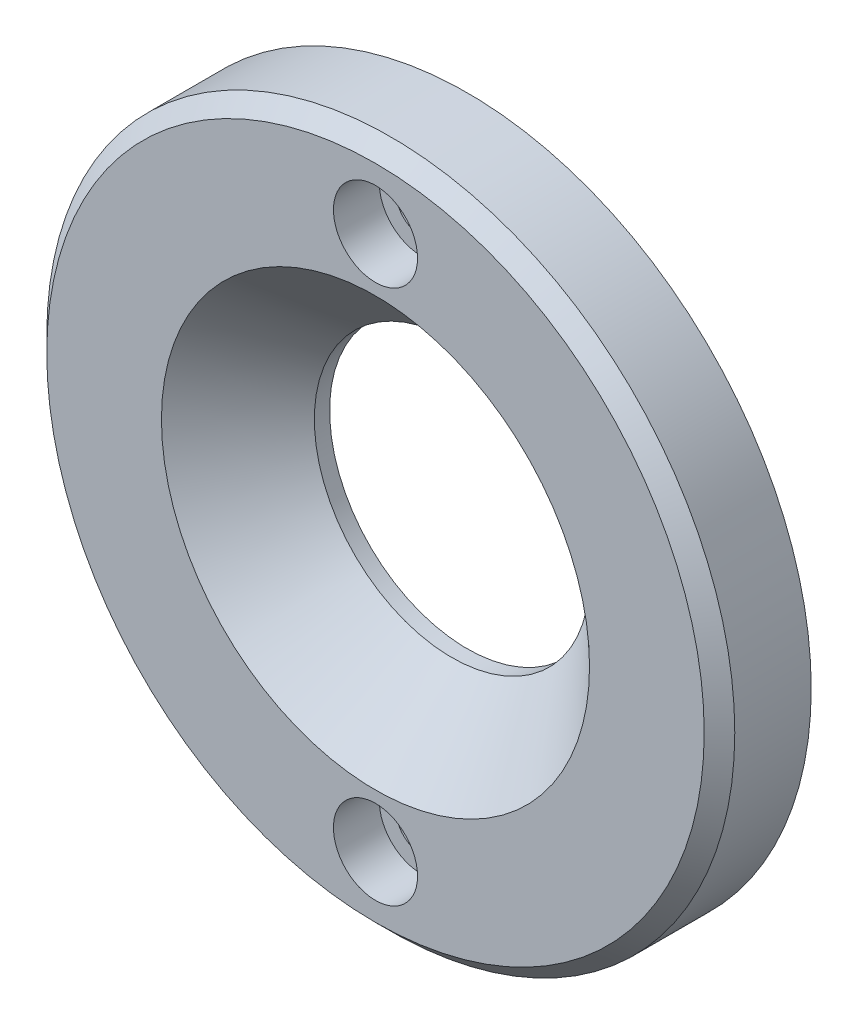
ISO-10303-21;
HEADER;
FILE_DESCRIPTION(('STEP AP214'),'2;1');
FILE_NAME('part.step','',(''),(''),'','','');
FILE_SCHEMA(('AUTOMOTIVE_DESIGN { 1 0 10303 214 1 1 1 1 }'));
ENDSEC;
DATA;
#1=APPLICATION_CONTEXT('core data for automotive mechanical design processes');
#2=APPLICATION_PROTOCOL_DEFINITION('international standard','automotive_design',2000,#1);
#3=PRODUCT_CONTEXT('',#1,'mechanical');
#4=PRODUCT('Part','Part','',(#3));
#5=PRODUCT_RELATED_PRODUCT_CATEGORY('part','',(#4));
#6=PRODUCT_DEFINITION_FORMATION('','',#4);
#7=PRODUCT_DEFINITION_CONTEXT('part definition',#1,'design');
#8=PRODUCT_DEFINITION('design','',#6,#7);
#9=PRODUCT_DEFINITION_SHAPE('','',#8);
#10=(LENGTH_UNIT() NAMED_UNIT(*) SI_UNIT(.MILLI.,.METRE.));
#11=(NAMED_UNIT(*) PLANE_ANGLE_UNIT() SI_UNIT($,.RADIAN.));
#12=(NAMED_UNIT(*) SI_UNIT($,.STERADIAN.) SOLID_ANGLE_UNIT());
#13=UNCERTAINTY_MEASURE_WITH_UNIT(LENGTH_MEASURE(1.E-05),#10,'distance_accuracy_value','');
#14=(GEOMETRIC_REPRESENTATION_CONTEXT(3) GLOBAL_UNCERTAINTY_ASSIGNED_CONTEXT((#13)) GLOBAL_UNIT_ASSIGNED_CONTEXT((#10,
#11,#12)) REPRESENTATION_CONTEXT('',''));
#15=CARTESIAN_POINT('',(0.,0.,0.));
#16=DIRECTION('',(0.,0.,1.));
#17=DIRECTION('',(1.,0.,0.));
#18=AXIS2_PLACEMENT_3D('',#15,#16,#17);
#19=CARTESIAN_POINT('',(2.17881268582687E-12,0.,12.));
#20=DIRECTION('',(0.,0.,-1.));
#21=DIRECTION('',(-0.999999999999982,0.,0.));
#22=AXIS2_PLACEMENT_3D('',#19,#20,#21);
#23=CYLINDRICAL_SURFACE('',#22,45.);
#24=CARTESIAN_POINT('',(2.17881268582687E-12,-2.19269047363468E-12,9.99999999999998));
#25=DIRECTION('',(0.,0.,1.));
#26=DIRECTION('',(0.999999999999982,0.,0.));
#27=AXIS2_PLACEMENT_3D('',#24,#25,#26);
#28=CIRCLE('',#27,45.);
#29=CARTESIAN_POINT('',(45.0000000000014,-1.39832589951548E-12,9.99999999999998));
#30=VERTEX_POINT('',#29);
#31=EDGE_CURVE('E53',#30,#30,#28,.F.);
#32=ORIENTED_EDGE('',*,*,#31,.T.);
#33=EDGE_LOOP('',(#32));
#34=FACE_BOUND('',#33,.T.);
#35=CARTESIAN_POINT('',(0.,0.,0.));
#36=DIRECTION('',(0.,0.,1.));
#37=DIRECTION('',(0.999999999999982,0.,0.));
#38=AXIS2_PLACEMENT_3D('',#35,#36,#37);
#39=CIRCLE('',#38,45.);
#40=CARTESIAN_POINT('',(44.9999999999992,7.94364574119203E-13,0.));
#41=VERTEX_POINT('',#40);
#42=EDGE_CURVE('E62',#41,#41,#39,.T.);
#43=ORIENTED_EDGE('',*,*,#42,.T.);
#44=EDGE_LOOP('',(#43));
#45=FACE_BOUND('',#44,.T.);
#46=ADVANCED_FACE('F43',(#34,#45),#23,.T.);
#47=CARTESIAN_POINT('',(2.17881268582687E-12,0.,12.));
#48=DIRECTION('',(0.,0.,1.));
#49=DIRECTION('',(0.999999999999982,0.,0.));
#50=AXIS2_PLACEMENT_3D('',#47,#48,#49);
#51=PLANE('',#50);
#52=CARTESIAN_POINT('',(2.23432383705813E-12,35.,12.));
#53=DIRECTION('',(0.,0.,1.));
#54=DIRECTION('',(0.999999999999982,0.,0.));
#55=AXIS2_PLACEMENT_3D('',#52,#53,#54);
#56=CIRCLE('',#55,5.49999999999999);
#57=CARTESIAN_POINT('',(5.50000000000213,35.0000000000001,12.));
#58=VERTEX_POINT('',#57);
#59=EDGE_CURVE('E80',#58,#58,#56,.T.);
#60=ORIENTED_EDGE('',*,*,#59,.F.);
#61=EDGE_LOOP('',(#60));
#62=FACE_BOUND('',#61,.T.);
#63=CARTESIAN_POINT('',(2.15105711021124E-12,-35.,12.));
#64=DIRECTION('',(0.,0.,1.));
#65=DIRECTION('',(0.999999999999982,0.,0.));
#66=AXIS2_PLACEMENT_3D('',#63,#64,#65);
#67=CIRCLE('',#66,5.49999999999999);
#68=CARTESIAN_POINT('',(5.50000000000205,-34.9999999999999,12.));
#69=VERTEX_POINT('',#68);
#70=EDGE_CURVE('E68',#69,#69,#67,.T.);
#71=ORIENTED_EDGE('',*,*,#70,.F.);
#72=EDGE_LOOP('',(#71));
#73=FACE_BOUND('',#72,.T.);
#74=CARTESIAN_POINT('',(2.17881268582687E-12,0.,12.));
#75=DIRECTION('',(0.,0.,1.));
#76=DIRECTION('',(0.999999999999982,0.,0.));
#77=AXIS2_PLACEMENT_3D('',#74,#75,#76);
#78=CIRCLE('',#77,28.);
#79=CARTESIAN_POINT('',(28.0000000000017,4.9427129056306E-13,12.));
#80=VERTEX_POINT('',#79);
#81=EDGE_CURVE('E12',#80,#80,#78,.F.);
#82=ORIENTED_EDGE('',*,*,#81,.T.);
#83=EDGE_LOOP('',(#82));
#84=FACE_BOUND('',#83,.T.);
#85=CARTESIAN_POINT('',(2.17881268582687E-12,0.,12.));
#86=DIRECTION('',(0.,0.,1.));
#87=DIRECTION('',(0.999999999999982,0.,0.));
#88=AXIS2_PLACEMENT_3D('',#85,#86,#87);
#89=CIRCLE('',#88,43.);
#90=CARTESIAN_POINT('',(43.0000000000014,7.59059481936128E-13,12.));
#91=VERTEX_POINT('',#90);
#92=EDGE_CURVE('E57',#91,#91,#89,.T.);
#93=ORIENTED_EDGE('',*,*,#92,.T.);
#94=EDGE_LOOP('',(#93));
#95=FACE_BOUND('',#94,.T.);
#96=ADVANCED_FACE('F115',(#62,#73,#84,#95),#51,.T.);
#97=CARTESIAN_POINT('',(0.,0.,0.));
#98=DIRECTION('',(0.,0.,1.));
#99=DIRECTION('',(0.999999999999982,0.,0.));
#100=AXIS2_PLACEMENT_3D('',#97,#98,#99);
#101=PLANE('',#100);
#102=CARTESIAN_POINT('',(0.,35.,1.10328413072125E-12));
#103=DIRECTION('',(0.,0.,1.));
#104=DIRECTION('',(0.999999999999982,0.,0.));
#105=AXIS2_PLACEMENT_3D('',#102,#103,#104);
#106=CIRCLE('',#105,3.3);
#107=CARTESIAN_POINT('',(3.30000000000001,35.0000000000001,1.10328413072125E-12));
#108=VERTEX_POINT('',#107);
#109=EDGE_CURVE('E89',#108,#108,#106,.T.);
#110=ORIENTED_EDGE('',*,*,#109,.T.);
#111=EDGE_LOOP('',(#110));
#112=FACE_BOUND('',#111,.T.);
#113=CARTESIAN_POINT('',(0.,-35.,0.));
#114=DIRECTION('',(0.,0.,1.));
#115=DIRECTION('',(0.999999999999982,0.,0.));
#116=AXIS2_PLACEMENT_3D('',#113,#114,#115);
#117=CIRCLE('',#116,3.3);
#118=CARTESIAN_POINT('',(3.29999999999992,-35.,0.));
#119=VERTEX_POINT('',#118);
#120=EDGE_CURVE('E77',#119,#119,#117,.T.);
#121=ORIENTED_EDGE('',*,*,#120,.T.);
#122=EDGE_LOOP('',(#121));
#123=FACE_BOUND('',#122,.T.);
#124=CARTESIAN_POINT('',(0.,0.,0.));
#125=DIRECTION('',(0.,0.,1.));
#126=DIRECTION('',(0.999999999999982,0.,0.));
#127=AXIS2_PLACEMENT_3D('',#124,#125,#126);
#128=CIRCLE('',#127,18.);
#129=CARTESIAN_POINT('',(17.9999999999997,3.17745829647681E-13,0.));
#130=VERTEX_POINT('',#129);
#131=EDGE_CURVE('E65',#130,#130,#128,.T.);
#132=ORIENTED_EDGE('',*,*,#131,.T.);
#133=EDGE_LOOP('',(#132));
#134=FACE_BOUND('',#133,.T.);
#135=ORIENTED_EDGE('',*,*,#42,.F.);
#136=EDGE_LOOP('',(#135));
#137=FACE_BOUND('',#136,.T.);
#138=ADVANCED_FACE('F93',(#112,#123,#134,#137),#101,.F.);
#139=CARTESIAN_POINT('',(2.17881268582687E-12,0.,12.));
#140=DIRECTION('',(0.,0.,-1.));
#141=DIRECTION('',(-0.999999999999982,0.,0.));
#142=AXIS2_PLACEMENT_3D('',#139,#140,#141);
#143=CONICAL_SURFACE('',#142,43.,0.785398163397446);
#144=ORIENTED_EDGE('',*,*,#31,.F.);
#145=EDGE_LOOP('',(#144));
#146=FACE_BOUND('',#145,.T.);
#147=ORIENTED_EDGE('',*,*,#92,.F.);
#148=EDGE_LOOP('',(#147));
#149=FACE_BOUND('',#148,.T.);
#150=ADVANCED_FACE('F122',(#146,#149),#143,.T.);
#151=CARTESIAN_POINT('',(0.,0.,0.));
#152=DIRECTION('',(0.,0.,1.));
#153=DIRECTION('',(0.999999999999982,0.,0.));
#154=AXIS2_PLACEMENT_3D('',#151,#152,#153);
#155=CYLINDRICAL_SURFACE('',#154,18.);
#156=CARTESIAN_POINT('',(2.17881268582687E-12,0.,2.));
#157=DIRECTION('',(0.,0.,1.));
#158=DIRECTION('',(0.999999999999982,0.,0.));
#159=AXIS2_PLACEMENT_3D('',#156,#157,#158);
#160=CIRCLE('',#159,18.);
#161=CARTESIAN_POINT('',(18.0000000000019,3.17745829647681E-13,2.));
#162=VERTEX_POINT('',#161);
#163=EDGE_CURVE('E49',#162,#162,#160,.T.);
#164=ORIENTED_EDGE('',*,*,#163,.T.);
#165=EDGE_LOOP('',(#164));
#166=FACE_BOUND('',#165,.T.);
#167=ORIENTED_EDGE('',*,*,#131,.F.);
#168=EDGE_LOOP('',(#167));
#169=FACE_BOUND('',#168,.T.);
#170=ADVANCED_FACE('F124',(#166,#169),#155,.F.);
#171=CARTESIAN_POINT('',(2.17881268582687E-12,0.,2.));
#172=DIRECTION('',(0.,0.,1.));
#173=DIRECTION('',(0.999999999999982,0.,0.));
#174=AXIS2_PLACEMENT_3D('',#171,#172,#173);
#175=CONICAL_SURFACE('',#174,18.,0.78539816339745);
#176=ORIENTED_EDGE('',*,*,#81,.F.);
#177=EDGE_LOOP('',(#176));
#178=FACE_BOUND('',#177,.T.);
#179=ORIENTED_EDGE('',*,*,#163,.F.);
#180=EDGE_LOOP('',(#179));
#181=FACE_BOUND('',#180,.T.);
#182=ADVANCED_FACE('F131',(#178,#181),#175,.F.);
#183=CARTESIAN_POINT('',(2.15105711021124E-12,-35.,12.));
#184=DIRECTION('',(0.,0.,1.));
#185=DIRECTION('',(0.999999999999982,0.,0.));
#186=AXIS2_PLACEMENT_3D('',#183,#184,#185);
#187=CYLINDRICAL_SURFACE('',#186,5.5);
#188=CARTESIAN_POINT('',(0.,-35.,6.00000000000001));
#189=DIRECTION('',(0.,0.,1.));
#190=DIRECTION('',(0.999999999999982,0.,0.));
#191=AXIS2_PLACEMENT_3D('',#188,#189,#190);
#192=CIRCLE('',#191,5.5);
#193=CARTESIAN_POINT('',(5.49999999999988,-34.9999999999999,6.00000000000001));
#194=VERTEX_POINT('',#193);
#195=EDGE_CURVE('E71',#194,#194,#192,.T.);
#196=ORIENTED_EDGE('',*,*,#195,.F.);
#197=EDGE_LOOP('',(#196));
#198=FACE_BOUND('',#197,.T.);
#199=ORIENTED_EDGE('',*,*,#70,.T.);
#200=EDGE_LOOP('',(#199));
#201=FACE_BOUND('',#200,.T.);
#202=ADVANCED_FACE('F169',(#198,#201),#187,.F.);
#203=CARTESIAN_POINT('',(3.29999999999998,-35.,6.00000000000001));
#204=DIRECTION('',(0.,0.,-1.));
#205=DIRECTION('',(-0.999999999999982,0.,0.));
#206=AXIS2_PLACEMENT_3D('',#203,#204,#205);
#207=PLANE('',#206);
#208=CARTESIAN_POINT('',(0.,-35.,6.00000000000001));
#209=DIRECTION('',(0.,0.,1.));
#210=DIRECTION('',(0.999999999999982,0.,0.));
#211=AXIS2_PLACEMENT_3D('',#208,#209,#210);
#212=CIRCLE('',#211,3.3);
#213=CARTESIAN_POINT('',(3.29999999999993,-35.,6.00000000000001));
#214=VERTEX_POINT('',#213);
#215=EDGE_CURVE('E74',#214,#214,#212,.T.);
#216=ORIENTED_EDGE('',*,*,#215,.F.);
#217=EDGE_LOOP('',(#216));
#218=FACE_BOUND('',#217,.T.);
#219=ORIENTED_EDGE('',*,*,#195,.T.);
#220=EDGE_LOOP('',(#219));
#221=FACE_BOUND('',#220,.T.);
#222=ADVANCED_FACE('F179',(#218,#221),#207,.F.);
#223=CARTESIAN_POINT('',(2.15105711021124E-12,-35.,12.));
#224=DIRECTION('',(0.,0.,1.));
#225=DIRECTION('',(0.999999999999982,0.,0.));
#226=AXIS2_PLACEMENT_3D('',#223,#224,#225);
#227=CYLINDRICAL_SURFACE('',#226,3.3);
#228=ORIENTED_EDGE('',*,*,#120,.F.);
#229=EDGE_LOOP('',(#228));
#230=FACE_BOUND('',#229,.T.);
#231=ORIENTED_EDGE('',*,*,#215,.T.);
#232=EDGE_LOOP('',(#231));
#233=FACE_BOUND('',#232,.T.);
#234=ADVANCED_FACE('F111',(#230,#233),#227,.F.);
#235=CARTESIAN_POINT('',(2.23432383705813E-12,35.,12.));
#236=DIRECTION('',(0.,0.,1.));
#237=DIRECTION('',(0.999999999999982,0.,0.));
#238=AXIS2_PLACEMENT_3D('',#235,#236,#237);
#239=CYLINDRICAL_SURFACE('',#238,5.5);
#240=CARTESIAN_POINT('',(0.,35.,6.00000000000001));
#241=DIRECTION('',(0.,0.,1.));
#242=DIRECTION('',(0.999999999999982,0.,0.));
#243=AXIS2_PLACEMENT_3D('',#240,#241,#242);
#244=CIRCLE('',#243,5.5);
#245=CARTESIAN_POINT('',(5.49999999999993,35.0000000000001,6.00000000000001));
#246=VERTEX_POINT('',#245);
#247=EDGE_CURVE('E83',#246,#246,#244,.T.);
#248=ORIENTED_EDGE('',*,*,#247,.F.);
#249=EDGE_LOOP('',(#248));
#250=FACE_BOUND('',#249,.T.);
#251=ORIENTED_EDGE('',*,*,#59,.T.);
#252=EDGE_LOOP('',(#251));
#253=FACE_BOUND('',#252,.T.);
#254=ADVANCED_FACE('F105',(#250,#253),#239,.F.);
#255=CARTESIAN_POINT('',(3.30000000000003,35.,6.00000000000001));
#256=DIRECTION('',(0.,0.,-1.));
#257=DIRECTION('',(-0.999999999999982,0.,0.));
#258=AXIS2_PLACEMENT_3D('',#255,#256,#257);
#259=PLANE('',#258);
#260=CARTESIAN_POINT('',(0.,35.,6.00000000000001));
#261=DIRECTION('',(0.,0.,1.));
#262=DIRECTION('',(0.999999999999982,0.,0.));
#263=AXIS2_PLACEMENT_3D('',#260,#261,#262);
#264=CIRCLE('',#263,3.3);
#265=CARTESIAN_POINT('',(3.29999999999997,35.0000000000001,6.00000000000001));
#266=VERTEX_POINT('',#265);
#267=EDGE_CURVE('E86',#266,#266,#264,.T.);
#268=ORIENTED_EDGE('',*,*,#267,.F.);
#269=EDGE_LOOP('',(#268));
#270=FACE_BOUND('',#269,.T.);
#271=ORIENTED_EDGE('',*,*,#247,.T.);
#272=EDGE_LOOP('',(#271));
#273=FACE_BOUND('',#272,.T.);
#274=ADVANCED_FACE('F99',(#270,#273),#259,.F.);
#275=CARTESIAN_POINT('',(2.23432383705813E-12,35.,12.));
#276=DIRECTION('',(0.,0.,1.));
#277=DIRECTION('',(0.999999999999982,0.,0.));
#278=AXIS2_PLACEMENT_3D('',#275,#276,#277);
#279=CYLINDRICAL_SURFACE('',#278,3.3);
#280=ORIENTED_EDGE('',*,*,#109,.F.);
#281=EDGE_LOOP('',(#280));
#282=FACE_BOUND('',#281,.T.);
#283=ORIENTED_EDGE('',*,*,#267,.T.);
#284=EDGE_LOOP('',(#283));
#285=FACE_BOUND('',#284,.T.);
#286=ADVANCED_FACE('F96',(#282,#285),#279,.F.);
#287=CLOSED_SHELL('',(#46,#96,#138,#150,#170,#182,#202,#222,#234,#254,#274,#286));
#288=MANIFOLD_SOLID_BREP('B2',#287);
#289=ADVANCED_BREP_SHAPE_REPRESENTATION('',(#18,#288),#14);
#290=SHAPE_DEFINITION_REPRESENTATION(#9,#289);
ENDSEC;
END-ISO-10303-21;
